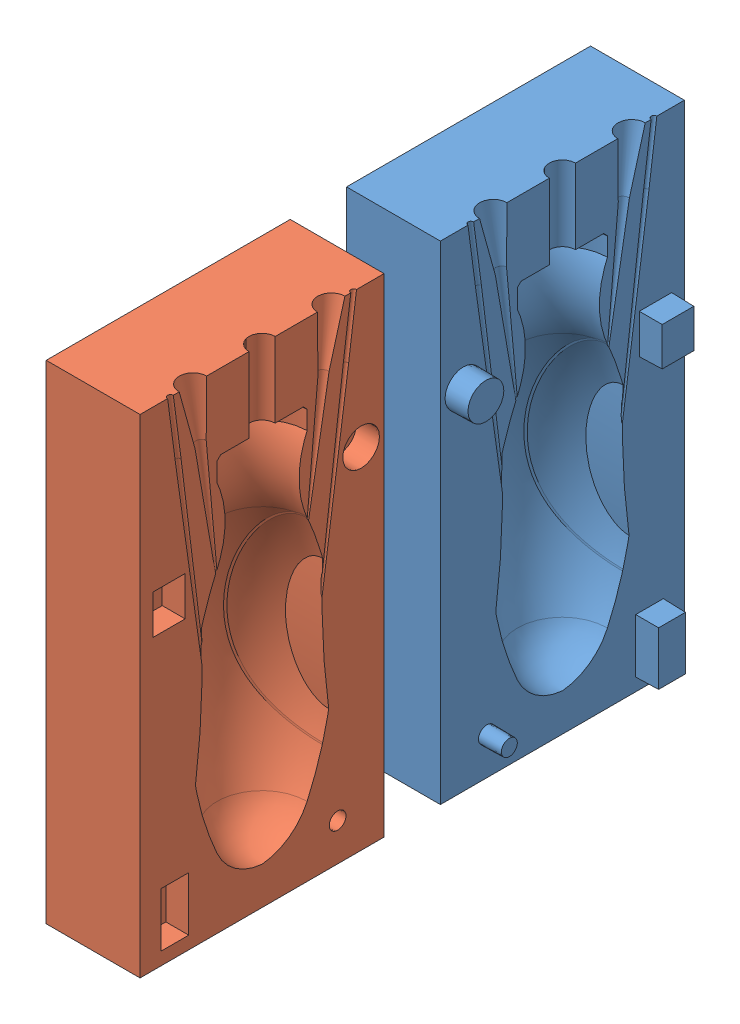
SolidWorks assembly MoldB.SLDASM, configuration Default (file format 11000). Lengths in mm.
Overall size (31 130 145).
2 component instances, 2 part files, 4 mates.
Components (placement in the parent):
- MoldB.1-2: MoldB.1.SLDPRT [Default] at origin size (31 130 65)
- MoldB.2-2: MoldB.2.SLDPRT [Default] at (0 0 80) x (-1 0 0) z (0 0 -1) size (26.93 130 65)
Mates (geometry in assembly coordinates):
- Parallel1: parallel: plane of MoldB.1-2 through (-25 120 32.5) normal (0 0 1); plane of MoldB.2-2 through (-25 120 53.7779) normal (0 0 -1)
- Coincident1: coincident: plane of MoldB.1-2 through (-25 -10 32.5) normal (0 -1 0); plane of MoldB.2-2 through (-25 -10 53.7779) normal (0 -1 0)
- Coincident2: coincident: plane of MoldB.1-2 through (-25 0 0) normal (-1 0 0); plane of MoldB.2-2 through (-25 0 86.2779) normal (-1 0 0)
- Distance1: distance = 15 mm: plane of MoldB.2-2 through (-25 120 47.5) normal (0 0 -1); plane of MoldB.1-2 through (-25 120 32.5) normal (0 0 1)
